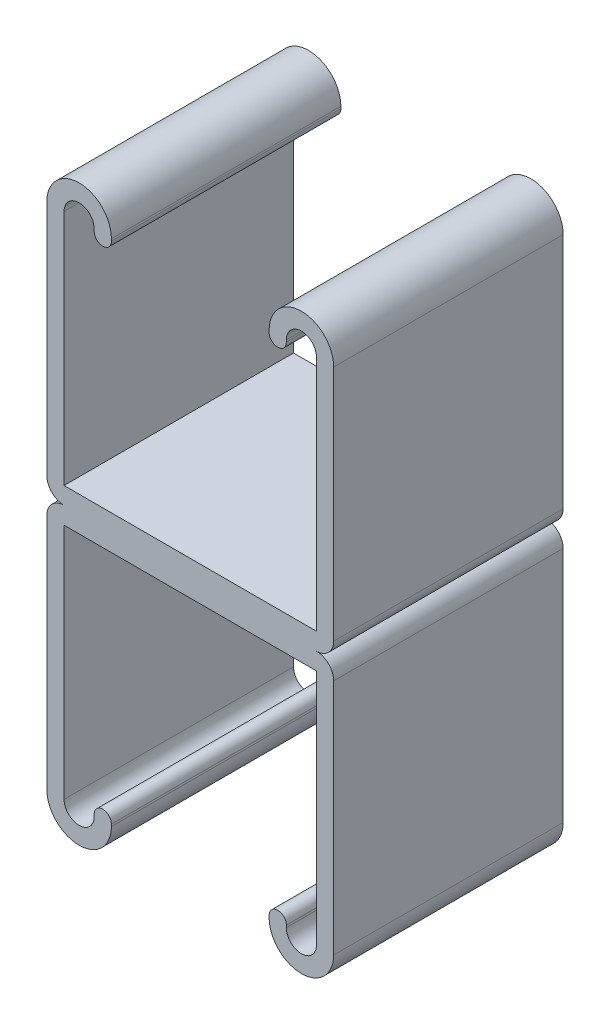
ISO-10303-21;
HEADER;
FILE_DESCRIPTION(('STEP AP214'),'2;1');
FILE_NAME('part.step','',(''),(''),'','','');
FILE_SCHEMA(('AUTOMOTIVE_DESIGN { 1 0 10303 214 1 1 1 1 }'));
ENDSEC;
DATA;
#1=APPLICATION_CONTEXT('core data for automotive mechanical design processes');
#2=APPLICATION_PROTOCOL_DEFINITION('international standard','automotive_design',2000,#1);
#3=PRODUCT_CONTEXT('',#1,'mechanical');
#4=PRODUCT('Part','Part','',(#3));
#5=PRODUCT_RELATED_PRODUCT_CATEGORY('part','',(#4));
#6=PRODUCT_DEFINITION_FORMATION('','',#4);
#7=PRODUCT_DEFINITION_CONTEXT('part definition',#1,'design');
#8=PRODUCT_DEFINITION('design','',#6,#7);
#9=PRODUCT_DEFINITION_SHAPE('','',#8);
#10=(LENGTH_UNIT() NAMED_UNIT(*) SI_UNIT(.MILLI.,.METRE.));
#11=(NAMED_UNIT(*) PLANE_ANGLE_UNIT() SI_UNIT($,.RADIAN.));
#12=(NAMED_UNIT(*) SI_UNIT($,.STERADIAN.) SOLID_ANGLE_UNIT());
#13=UNCERTAINTY_MEASURE_WITH_UNIT(LENGTH_MEASURE(1.E-05),#10,'distance_accuracy_value','');
#14=(GEOMETRIC_REPRESENTATION_CONTEXT(3) GLOBAL_UNCERTAINTY_ASSIGNED_CONTEXT((#13)) GLOBAL_UNIT_ASSIGNED_CONTEXT((#10,
#11,#12)) REPRESENTATION_CONTEXT('',''));
#15=CARTESIAN_POINT('',(0.,0.,0.));
#16=DIRECTION('',(0.,0.,1.));
#17=DIRECTION('',(1.,0.,0.));
#18=AXIS2_PLACEMENT_3D('',#15,#16,#17);
#19=CARTESIAN_POINT('',(-12.303125,28.178125,12.7));
#20=DIRECTION('',(0.,0.,-1.));
#21=DIRECTION('',(-1.,0.,0.));
#22=AXIS2_PLACEMENT_3D('',#19,#20,#21);
#23=CYLINDRICAL_SURFACE('',#22,3.571875);
#24=CARTESIAN_POINT('',(-12.303125,28.178125,-12.7));
#25=DIRECTION('',(0.,0.,1.));
#26=DIRECTION('',(-1.,0.,0.));
#27=AXIS2_PLACEMENT_3D('',#24,#25,#26);
#28=CIRCLE('',#27,3.571875);
#29=CARTESIAN_POINT('',(-8.73125,28.178125,-12.7));
#30=VERTEX_POINT('',#29);
#31=CARTESIAN_POINT('',(-15.875,28.178125,-12.7));
#32=VERTEX_POINT('',#31);
#33=EDGE_CURVE('E196',#30,#32,#28,.T.);
#34=ORIENTED_EDGE('',*,*,#33,.T.);
#35=DIRECTION('',(0.,0.,-1.));
#36=VECTOR('',#35,1.);
#37=CARTESIAN_POINT('',(-15.875,28.178125,12.7));
#38=LINE('',#37,#36);
#39=CARTESIAN_POINT('',(-15.875,28.178125,12.7));
#40=VERTEX_POINT('',#39);
#41=EDGE_CURVE('E11',#40,#32,#38,.T.);
#42=ORIENTED_EDGE('',*,*,#41,.F.);
#43=CARTESIAN_POINT('',(-12.303125,28.178125,12.7));
#44=DIRECTION('',(0.,0.,1.));
#45=DIRECTION('',(-1.,0.,0.));
#46=AXIS2_PLACEMENT_3D('',#43,#44,#45);
#47=CIRCLE('',#46,3.571875);
#48=CARTESIAN_POINT('',(-8.73125,28.178125,12.7));
#49=VERTEX_POINT('',#48);
#50=EDGE_CURVE('E229',#49,#40,#47,.T.);
#51=ORIENTED_EDGE('',*,*,#50,.F.);
#52=DIRECTION('',(0.,0.,-1.));
#53=VECTOR('',#52,1.);
#54=CARTESIAN_POINT('',(-8.73125,28.178125,12.7));
#55=LINE('',#54,#53);
#56=EDGE_CURVE('E192',#49,#30,#55,.T.);
#57=ORIENTED_EDGE('',*,*,#56,.T.);
#58=EDGE_LOOP('',(#34,#42,#51,#57));
#59=FACE_BOUND('',#58,.T.);
#60=ADVANCED_FACE('F39',(#59),#23,.T.);
#61=CARTESIAN_POINT('',(-15.875,28.178125,12.7));
#62=DIRECTION('',(1.,0.,0.));
#63=DIRECTION('',(0.,1.,0.));
#64=AXIS2_PLACEMENT_3D('',#61,#62,#63);
#65=PLANE('',#64);
#66=DIRECTION('',(0.,-1.,0.));
#67=VECTOR('',#66,1.);
#68=CARTESIAN_POINT('',(-15.875,28.178125,-12.7));
#69=LINE('',#68,#67);
#70=CARTESIAN_POINT('',(-15.875,1.905,-12.7));
#71=VERTEX_POINT('',#70);
#72=EDGE_CURVE('E199',#32,#71,#69,.T.);
#73=ORIENTED_EDGE('',*,*,#72,.T.);
#74=DIRECTION('',(0.,0.,-1.));
#75=VECTOR('',#74,1.);
#76=CARTESIAN_POINT('',(-15.875,1.905,12.7));
#77=LINE('',#76,#75);
#78=CARTESIAN_POINT('',(-15.875,1.905,12.7));
#79=VERTEX_POINT('',#78);
#80=EDGE_CURVE('E47',#79,#71,#77,.T.);
#81=ORIENTED_EDGE('',*,*,#80,.F.);
#82=DIRECTION('',(0.,-1.,0.));
#83=VECTOR('',#82,1.);
#84=CARTESIAN_POINT('',(-15.875,28.178125,12.7));
#85=LINE('',#84,#83);
#86=EDGE_CURVE('E126',#40,#79,#85,.T.);
#87=ORIENTED_EDGE('',*,*,#86,.F.);
#88=ORIENTED_EDGE('',*,*,#41,.T.);
#89=EDGE_LOOP('',(#73,#81,#87,#88));
#90=FACE_BOUND('',#89,.T.);
#91=ADVANCED_FACE('F392',(#90),#65,.F.);
#92=CARTESIAN_POINT('',(-13.97,1.905,12.7));
#93=DIRECTION('',(0.,0.,-1.));
#94=DIRECTION('',(-1.,0.,0.));
#95=AXIS2_PLACEMENT_3D('',#92,#93,#94);
#96=CYLINDRICAL_SURFACE('',#95,1.905);
#97=CARTESIAN_POINT('',(-13.97,1.905,-12.7));
#98=DIRECTION('',(0.,0.,1.));
#99=DIRECTION('',(-1.,0.,0.));
#100=AXIS2_PLACEMENT_3D('',#97,#98,#99);
#101=CIRCLE('',#100,1.905);
#102=CARTESIAN_POINT('',(-13.97,0.,-12.7));
#103=VERTEX_POINT('',#102);
#104=EDGE_CURVE('E202',#71,#103,#101,.T.);
#105=ORIENTED_EDGE('',*,*,#104,.T.);
#106=DIRECTION('',(0.,0.,-1.));
#107=VECTOR('',#106,1.);
#108=CARTESIAN_POINT('',(-13.97,0.,12.7));
#109=LINE('',#108,#107);
#110=CARTESIAN_POINT('',(-13.97,0.,12.7));
#111=VERTEX_POINT('',#110);
#112=EDGE_CURVE('E266',#111,#103,#109,.T.);
#113=ORIENTED_EDGE('',*,*,#112,.F.);
#114=CARTESIAN_POINT('',(-13.97,1.905,12.7));
#115=DIRECTION('',(0.,0.,1.));
#116=DIRECTION('',(-1.,0.,0.));
#117=AXIS2_PLACEMENT_3D('',#114,#115,#116);
#118=CIRCLE('',#117,1.905);
#119=EDGE_CURVE('E274',#79,#111,#118,.T.);
#120=ORIENTED_EDGE('',*,*,#119,.F.);
#121=ORIENTED_EDGE('',*,*,#80,.T.);
#122=EDGE_LOOP('',(#105,#113,#120,#121));
#123=FACE_BOUND('',#122,.T.);
#124=ADVANCED_FACE('F272',(#123),#96,.T.);
#125=CARTESIAN_POINT('',(13.97,1.905,12.7));
#126=DIRECTION('',(0.,0.,-1.));
#127=DIRECTION('',(-1.,0.,0.));
#128=AXIS2_PLACEMENT_3D('',#125,#126,#127);
#129=CYLINDRICAL_SURFACE('',#128,1.905);
#130=CARTESIAN_POINT('',(13.97,1.905,-12.7));
#131=DIRECTION('',(0.,0.,1.));
#132=DIRECTION('',(1.,0.,0.));
#133=AXIS2_PLACEMENT_3D('',#130,#131,#132);
#134=CIRCLE('',#133,1.905);
#135=CARTESIAN_POINT('',(13.97,0.,-12.7));
#136=VERTEX_POINT('',#135);
#137=CARTESIAN_POINT('',(15.875,1.905,-12.7));
#138=VERTEX_POINT('',#137);
#139=EDGE_CURVE('E204',#136,#138,#134,.T.);
#140=ORIENTED_EDGE('',*,*,#139,.T.);
#141=DIRECTION('',(0.,0.,-1.));
#142=VECTOR('',#141,1.);
#143=CARTESIAN_POINT('',(15.875,1.905,12.7));
#144=LINE('',#143,#142);
#145=CARTESIAN_POINT('',(15.875,1.905,12.7));
#146=VERTEX_POINT('',#145);
#147=EDGE_CURVE('E260',#146,#138,#144,.T.);
#148=ORIENTED_EDGE('',*,*,#147,.F.);
#149=CARTESIAN_POINT('',(13.97,1.905,12.7));
#150=DIRECTION('',(0.,0.,1.));
#151=DIRECTION('',(1.,0.,0.));
#152=AXIS2_PLACEMENT_3D('',#149,#150,#151);
#153=CIRCLE('',#152,1.905);
#154=CARTESIAN_POINT('',(13.97,0.,12.7));
#155=VERTEX_POINT('',#154);
#156=EDGE_CURVE('E348',#155,#146,#153,.T.);
#157=ORIENTED_EDGE('',*,*,#156,.F.);
#158=DIRECTION('',(0.,0.,-1.));
#159=VECTOR('',#158,1.);
#160=CARTESIAN_POINT('',(13.97,0.,12.7));
#161=LINE('',#160,#159);
#162=EDGE_CURVE('E263',#155,#136,#161,.T.);
#163=ORIENTED_EDGE('',*,*,#162,.T.);
#164=EDGE_LOOP('',(#140,#148,#157,#163));
#165=FACE_BOUND('',#164,.T.);
#166=ADVANCED_FACE('F399',(#165),#129,.T.);
#167=CARTESIAN_POINT('',(15.875,1.905,12.7));
#168=DIRECTION('',(-1.,0.,0.));
#169=DIRECTION('',(0.,0.,1.));
#170=AXIS2_PLACEMENT_3D('',#167,#168,#169);
#171=PLANE('',#170);
#172=DIRECTION('',(0.,1.,0.));
#173=VECTOR('',#172,1.);
#174=CARTESIAN_POINT('',(15.875,1.905,-12.7));
#175=LINE('',#174,#173);
#176=CARTESIAN_POINT('',(15.875,28.178125,-12.7));
#177=VERTEX_POINT('',#176);
#178=EDGE_CURVE('E206',#138,#177,#175,.T.);
#179=ORIENTED_EDGE('',*,*,#178,.T.);
#180=DIRECTION('',(0.,0.,-1.));
#181=VECTOR('',#180,1.);
#182=CARTESIAN_POINT('',(15.875,28.178125,12.7));
#183=LINE('',#182,#181);
#184=CARTESIAN_POINT('',(15.875,28.178125,12.7));
#185=VERTEX_POINT('',#184);
#186=EDGE_CURVE('E257',#185,#177,#183,.T.);
#187=ORIENTED_EDGE('',*,*,#186,.F.);
#188=DIRECTION('',(0.,1.,0.));
#189=VECTOR('',#188,1.);
#190=CARTESIAN_POINT('',(15.875,1.905,12.7));
#191=LINE('',#190,#189);
#192=EDGE_CURVE('E350',#146,#185,#191,.T.);
#193=ORIENTED_EDGE('',*,*,#192,.F.);
#194=ORIENTED_EDGE('',*,*,#147,.T.);
#195=EDGE_LOOP('',(#179,#187,#193,#194));
#196=FACE_BOUND('',#195,.T.);
#197=ADVANCED_FACE('F404',(#196),#171,.F.);
#198=CARTESIAN_POINT('',(12.303125,28.178125,12.7));
#199=DIRECTION('',(0.,0.,-1.));
#200=DIRECTION('',(-1.,0.,0.));
#201=AXIS2_PLACEMENT_3D('',#198,#199,#200);
#202=CYLINDRICAL_SURFACE('',#201,3.571875);
#203=CARTESIAN_POINT('',(12.303125,28.178125,-12.7));
#204=DIRECTION('',(0.,0.,1.));
#205=DIRECTION('',(1.,0.,0.));
#206=AXIS2_PLACEMENT_3D('',#203,#204,#205);
#207=CIRCLE('',#206,3.571875);
#208=CARTESIAN_POINT('',(8.73125,28.178125,-12.7));
#209=VERTEX_POINT('',#208);
#210=EDGE_CURVE('E208',#177,#209,#207,.T.);
#211=ORIENTED_EDGE('',*,*,#210,.T.);
#212=DIRECTION('',(0.,0.,-1.));
#213=VECTOR('',#212,1.);
#214=CARTESIAN_POINT('',(8.73125,28.178125,12.7));
#215=LINE('',#214,#213);
#216=CARTESIAN_POINT('',(8.73125,28.178125,12.7));
#217=VERTEX_POINT('',#216);
#218=EDGE_CURVE('E254',#217,#209,#215,.T.);
#219=ORIENTED_EDGE('',*,*,#218,.F.);
#220=CARTESIAN_POINT('',(12.303125,28.178125,12.7));
#221=DIRECTION('',(0.,0.,1.));
#222=DIRECTION('',(1.,0.,0.));
#223=AXIS2_PLACEMENT_3D('',#220,#221,#222);
#224=CIRCLE('',#223,3.571875);
#225=EDGE_CURVE('E352',#185,#217,#224,.T.);
#226=ORIENTED_EDGE('',*,*,#225,.F.);
#227=ORIENTED_EDGE('',*,*,#186,.T.);
#228=EDGE_LOOP('',(#211,#219,#226,#227));
#229=FACE_BOUND('',#228,.T.);
#230=ADVANCED_FACE('F407',(#229),#202,.T.);
#231=CARTESIAN_POINT('',(8.73125,28.178125,12.7));
#232=DIRECTION('',(1.,0.,0.));
#233=DIRECTION('',(0.,1.,0.));
#234=AXIS2_PLACEMENT_3D('',#231,#232,#233);
#235=PLANE('',#234);
#236=DIRECTION('',(0.,-1.,0.));
#237=VECTOR('',#236,1.);
#238=CARTESIAN_POINT('',(8.73125,28.178125,-12.7));
#239=LINE('',#238,#237);
#240=CARTESIAN_POINT('',(8.73125,27.94,-12.7));
#241=VERTEX_POINT('',#240);
#242=EDGE_CURVE('E210',#209,#241,#239,.T.);
#243=ORIENTED_EDGE('',*,*,#242,.T.);
#244=DIRECTION('',(0.,0.,-1.));
#245=VECTOR('',#244,1.);
#246=CARTESIAN_POINT('',(8.73125,27.94,12.7));
#247=LINE('',#246,#245);
#248=CARTESIAN_POINT('',(8.73125,27.94,12.7));
#249=VERTEX_POINT('',#248);
#250=EDGE_CURVE('E251',#249,#241,#247,.T.);
#251=ORIENTED_EDGE('',*,*,#250,.F.);
#252=DIRECTION('',(0.,-1.,0.));
#253=VECTOR('',#252,1.);
#254=CARTESIAN_POINT('',(8.73125,28.178125,12.7));
#255=LINE('',#254,#253);
#256=EDGE_CURVE('E354',#217,#249,#255,.T.);
#257=ORIENTED_EDGE('',*,*,#256,.F.);
#258=ORIENTED_EDGE('',*,*,#218,.T.);
#259=EDGE_LOOP('',(#243,#251,#257,#258));
#260=FACE_BOUND('',#259,.T.);
#261=ADVANCED_FACE('F411',(#260),#235,.F.);
#262=CARTESIAN_POINT('',(9.68375,27.94,12.7));
#263=DIRECTION('',(0.,0.,-1.));
#264=DIRECTION('',(-1.,0.,0.));
#265=AXIS2_PLACEMENT_3D('',#262,#263,#264);
#266=CYLINDRICAL_SURFACE('',#265,0.9525);
#267=CARTESIAN_POINT('',(9.68375,27.94,-12.7));
#268=DIRECTION('',(0.,0.,1.));
#269=DIRECTION('',(1.,0.,0.));
#270=AXIS2_PLACEMENT_3D('',#267,#268,#269);
#271=CIRCLE('',#270,0.9525);
#272=CARTESIAN_POINT('',(10.63625,27.94,-12.7));
#273=VERTEX_POINT('',#272);
#274=EDGE_CURVE('E212',#241,#273,#271,.T.);
#275=ORIENTED_EDGE('',*,*,#274,.T.);
#276=DIRECTION('',(0.,0.,-1.));
#277=VECTOR('',#276,1.);
#278=CARTESIAN_POINT('',(10.63625,27.94,12.7));
#279=LINE('',#278,#277);
#280=CARTESIAN_POINT('',(10.63625,27.94,12.7));
#281=VERTEX_POINT('',#280);
#282=EDGE_CURVE('E248',#281,#273,#279,.T.);
#283=ORIENTED_EDGE('',*,*,#282,.F.);
#284=CARTESIAN_POINT('',(9.68375,27.94,12.7));
#285=DIRECTION('',(0.,0.,1.));
#286=DIRECTION('',(1.,0.,0.));
#287=AXIS2_PLACEMENT_3D('',#284,#285,#286);
#288=CIRCLE('',#287,0.9525);
#289=EDGE_CURVE('E356',#249,#281,#288,.T.);
#290=ORIENTED_EDGE('',*,*,#289,.F.);
#291=ORIENTED_EDGE('',*,*,#250,.T.);
#292=EDGE_LOOP('',(#275,#283,#290,#291));
#293=FACE_BOUND('',#292,.T.);
#294=ADVANCED_FACE('F415',(#293),#266,.T.);
#295=CARTESIAN_POINT('',(10.63625,28.178125,12.7));
#296=DIRECTION('',(-1.,0.,0.));
#297=DIRECTION('',(0.,0.,1.));
#298=AXIS2_PLACEMENT_3D('',#295,#296,#297);
#299=PLANE('',#298);
#300=DIRECTION('',(0.,1.,0.));
#301=VECTOR('',#300,1.);
#302=CARTESIAN_POINT('',(10.63625,28.178125,-12.7));
#303=LINE('',#302,#301);
#304=CARTESIAN_POINT('',(10.63625,28.178125,-12.7));
#305=VERTEX_POINT('',#304);
#306=EDGE_CURVE('E214',#273,#305,#303,.T.);
#307=ORIENTED_EDGE('',*,*,#306,.T.);
#308=DIRECTION('',(0.,0.,-1.));
#309=VECTOR('',#308,1.);
#310=CARTESIAN_POINT('',(10.63625,28.178125,12.7));
#311=LINE('',#310,#309);
#312=CARTESIAN_POINT('',(10.63625,28.178125,12.7));
#313=VERTEX_POINT('',#312);
#314=EDGE_CURVE('E245',#313,#305,#311,.T.);
#315=ORIENTED_EDGE('',*,*,#314,.F.);
#316=DIRECTION('',(0.,1.,0.));
#317=VECTOR('',#316,1.);
#318=CARTESIAN_POINT('',(10.63625,28.178125,12.7));
#319=LINE('',#318,#317);
#320=EDGE_CURVE('E358',#281,#313,#319,.T.);
#321=ORIENTED_EDGE('',*,*,#320,.F.);
#322=ORIENTED_EDGE('',*,*,#282,.T.);
#323=EDGE_LOOP('',(#307,#315,#321,#322));
#324=FACE_BOUND('',#323,.T.);
#325=ADVANCED_FACE('F419',(#324),#299,.F.);
#326=CARTESIAN_POINT('',(12.303125,28.178125,12.7));
#327=DIRECTION('',(0.,0.,-1.));
#328=DIRECTION('',(-1.,0.,0.));
#329=AXIS2_PLACEMENT_3D('',#326,#327,#328);
#330=CYLINDRICAL_SURFACE('',#329,1.666875);
#331=CARTESIAN_POINT('',(12.303125,28.178125,-12.7));
#332=DIRECTION('',(0.,0.,-1.));
#333=DIRECTION('',(1.,0.,0.));
#334=AXIS2_PLACEMENT_3D('',#331,#332,#333);
#335=CIRCLE('',#334,1.666875);
#336=CARTESIAN_POINT('',(13.97,28.178125,-12.7));
#337=VERTEX_POINT('',#336);
#338=EDGE_CURVE('E216',#305,#337,#335,.T.);
#339=ORIENTED_EDGE('',*,*,#338,.T.);
#340=DIRECTION('',(0.,0.,-1.));
#341=VECTOR('',#340,1.);
#342=CARTESIAN_POINT('',(13.97,28.178125,12.7));
#343=LINE('',#342,#341);
#344=CARTESIAN_POINT('',(13.97,28.178125,12.7));
#345=VERTEX_POINT('',#344);
#346=EDGE_CURVE('E242',#345,#337,#343,.T.);
#347=ORIENTED_EDGE('',*,*,#346,.F.);
#348=CARTESIAN_POINT('',(12.303125,28.178125,12.7));
#349=DIRECTION('',(0.,0.,-1.));
#350=DIRECTION('',(1.,0.,0.));
#351=AXIS2_PLACEMENT_3D('',#348,#349,#350);
#352=CIRCLE('',#351,1.666875);
#353=EDGE_CURVE('E360',#313,#345,#352,.T.);
#354=ORIENTED_EDGE('',*,*,#353,.F.);
#355=ORIENTED_EDGE('',*,*,#314,.T.);
#356=EDGE_LOOP('',(#339,#347,#354,#355));
#357=FACE_BOUND('',#356,.T.);
#358=ADVANCED_FACE('F423',(#357),#330,.F.);
#359=CARTESIAN_POINT('',(13.97,1.905,12.7));
#360=DIRECTION('',(1.,0.,0.));
#361=DIRECTION('',(0.,0.,-1.));
#362=AXIS2_PLACEMENT_3D('',#359,#360,#361);
#363=PLANE('',#362);
#364=DIRECTION('',(0.,-1.,0.));
#365=VECTOR('',#364,1.);
#366=CARTESIAN_POINT('',(13.97,1.905,-12.7));
#367=LINE('',#366,#365);
#368=CARTESIAN_POINT('',(13.97,1.905,-12.7));
#369=VERTEX_POINT('',#368);
#370=EDGE_CURVE('E218',#337,#369,#367,.T.);
#371=ORIENTED_EDGE('',*,*,#370,.T.);
#372=DIRECTION('',(0.,0.,-1.));
#373=VECTOR('',#372,1.);
#374=CARTESIAN_POINT('',(13.97,1.905,12.7));
#375=LINE('',#374,#373);
#376=CARTESIAN_POINT('',(13.97,1.905,12.7));
#377=VERTEX_POINT('',#376);
#378=EDGE_CURVE('E239',#377,#369,#375,.T.);
#379=ORIENTED_EDGE('',*,*,#378,.F.);
#380=DIRECTION('',(0.,-1.,0.));
#381=VECTOR('',#380,1.);
#382=CARTESIAN_POINT('',(13.97,1.905,12.7));
#383=LINE('',#382,#381);
#384=EDGE_CURVE('E362',#345,#377,#383,.T.);
#385=ORIENTED_EDGE('',*,*,#384,.F.);
#386=ORIENTED_EDGE('',*,*,#346,.T.);
#387=EDGE_LOOP('',(#371,#379,#385,#386));
#388=FACE_BOUND('',#387,.T.);
#389=ADVANCED_FACE('F427',(#388),#363,.F.);
#390=CARTESIAN_POINT('',(-13.97,1.905,12.7));
#391=DIRECTION('',(0.,-1.,0.));
#392=DIRECTION('',(1.,0.,0.));
#393=AXIS2_PLACEMENT_3D('',#390,#391,#392);
#394=PLANE('',#393);
#395=DIRECTION('',(-1.,0.,0.));
#396=VECTOR('',#395,1.);
#397=CARTESIAN_POINT('',(-13.97,1.905,-12.7));
#398=LINE('',#397,#396);
#399=CARTESIAN_POINT('',(-13.97,1.905,-12.7));
#400=VERTEX_POINT('',#399);
#401=EDGE_CURVE('E220',#369,#400,#398,.T.);
#402=ORIENTED_EDGE('',*,*,#401,.T.);
#403=DIRECTION('',(0.,0.,-1.));
#404=VECTOR('',#403,1.);
#405=CARTESIAN_POINT('',(-13.97,1.905,12.7));
#406=LINE('',#405,#404);
#407=CARTESIAN_POINT('',(-13.97,1.905,12.7));
#408=VERTEX_POINT('',#407);
#409=EDGE_CURVE('E236',#408,#400,#406,.T.);
#410=ORIENTED_EDGE('',*,*,#409,.F.);
#411=DIRECTION('',(-1.,0.,0.));
#412=VECTOR('',#411,1.);
#413=CARTESIAN_POINT('',(-13.97,1.905,12.7));
#414=LINE('',#413,#412);
#415=EDGE_CURVE('E364',#377,#408,#414,.T.);
#416=ORIENTED_EDGE('',*,*,#415,.F.);
#417=ORIENTED_EDGE('',*,*,#378,.T.);
#418=EDGE_LOOP('',(#402,#410,#416,#417));
#419=FACE_BOUND('',#418,.T.);
#420=ADVANCED_FACE('F431',(#419),#394,.F.);
#421=CARTESIAN_POINT('',(-13.97,28.178125,12.7));
#422=DIRECTION('',(-1.,0.,0.));
#423=DIRECTION('',(0.,-1.,0.));
#424=AXIS2_PLACEMENT_3D('',#421,#422,#423);
#425=PLANE('',#424);
#426=DIRECTION('',(0.,1.,0.));
#427=VECTOR('',#426,1.);
#428=CARTESIAN_POINT('',(-13.97,28.178125,-12.7));
#429=LINE('',#428,#427);
#430=CARTESIAN_POINT('',(-13.97,28.178125,-12.7));
#431=VERTEX_POINT('',#430);
#432=EDGE_CURVE('E222',#400,#431,#429,.T.);
#433=ORIENTED_EDGE('',*,*,#432,.T.);
#434=DIRECTION('',(0.,0.,-1.));
#435=VECTOR('',#434,1.);
#436=CARTESIAN_POINT('',(-13.97,28.178125,12.7));
#437=LINE('',#436,#435);
#438=CARTESIAN_POINT('',(-13.97,28.178125,12.7));
#439=VERTEX_POINT('',#438);
#440=EDGE_CURVE('E233',#439,#431,#437,.T.);
#441=ORIENTED_EDGE('',*,*,#440,.F.);
#442=DIRECTION('',(0.,1.,0.));
#443=VECTOR('',#442,1.);
#444=CARTESIAN_POINT('',(-13.97,28.178125,12.7));
#445=LINE('',#444,#443);
#446=EDGE_CURVE('E366',#408,#439,#445,.T.);
#447=ORIENTED_EDGE('',*,*,#446,.F.);
#448=ORIENTED_EDGE('',*,*,#409,.T.);
#449=EDGE_LOOP('',(#433,#441,#447,#448));
#450=FACE_BOUND('',#449,.T.);
#451=ADVANCED_FACE('F372',(#450),#425,.F.);
#452=CARTESIAN_POINT('',(-12.303125,28.178125,12.7));
#453=DIRECTION('',(0.,0.,-1.));
#454=DIRECTION('',(-1.,0.,0.));
#455=AXIS2_PLACEMENT_3D('',#452,#453,#454);
#456=CYLINDRICAL_SURFACE('',#455,1.666875);
#457=CARTESIAN_POINT('',(-12.303125,28.178125,-12.7));
#458=DIRECTION('',(0.,0.,-1.));
#459=DIRECTION('',(-1.,0.,0.));
#460=AXIS2_PLACEMENT_3D('',#457,#458,#459);
#461=CIRCLE('',#460,1.666875);
#462=CARTESIAN_POINT('',(-10.63625,28.178125,-12.7));
#463=VERTEX_POINT('',#462);
#464=EDGE_CURVE('E224',#431,#463,#461,.T.);
#465=ORIENTED_EDGE('',*,*,#464,.T.);
#466=DIRECTION('',(0.,0.,-1.));
#467=VECTOR('',#466,1.);
#468=CARTESIAN_POINT('',(-10.63625,28.178125,12.7));
#469=LINE('',#468,#467);
#470=CARTESIAN_POINT('',(-10.63625,28.178125,12.7));
#471=VERTEX_POINT('',#470);
#472=EDGE_CURVE('E187',#471,#463,#469,.T.);
#473=ORIENTED_EDGE('',*,*,#472,.F.);
#474=CARTESIAN_POINT('',(-12.303125,28.178125,12.7));
#475=DIRECTION('',(0.,0.,-1.));
#476=DIRECTION('',(-1.,0.,0.));
#477=AXIS2_PLACEMENT_3D('',#474,#475,#476);
#478=CIRCLE('',#477,1.666875);
#479=EDGE_CURVE('E178',#439,#471,#478,.T.);
#480=ORIENTED_EDGE('',*,*,#479,.F.);
#481=ORIENTED_EDGE('',*,*,#440,.T.);
#482=EDGE_LOOP('',(#465,#473,#480,#481));
#483=FACE_BOUND('',#482,.T.);
#484=ADVANCED_FACE('F376',(#483),#456,.F.);
#485=CARTESIAN_POINT('',(-10.63625,28.178125,12.7));
#486=DIRECTION('',(1.,0.,0.));
#487=DIRECTION('',(0.,1.,0.));
#488=AXIS2_PLACEMENT_3D('',#485,#486,#487);
#489=PLANE('',#488);
#490=DIRECTION('',(0.,-1.,0.));
#491=VECTOR('',#490,1.);
#492=CARTESIAN_POINT('',(-10.63625,28.178125,-12.7));
#493=LINE('',#492,#491);
#494=CARTESIAN_POINT('',(-10.63625,27.94,-12.7));
#495=VERTEX_POINT('',#494);
#496=EDGE_CURVE('E186',#463,#495,#493,.T.);
#497=ORIENTED_EDGE('',*,*,#496,.T.);
#498=DIRECTION('',(0.,0.,-1.));
#499=VECTOR('',#498,1.);
#500=CARTESIAN_POINT('',(-10.63625,27.94,12.7));
#501=LINE('',#500,#499);
#502=CARTESIAN_POINT('',(-10.63625,27.94,12.7));
#503=VERTEX_POINT('',#502);
#504=EDGE_CURVE('E183',#503,#495,#501,.T.);
#505=ORIENTED_EDGE('',*,*,#504,.F.);
#506=DIRECTION('',(0.,-1.,0.));
#507=VECTOR('',#506,1.);
#508=CARTESIAN_POINT('',(-10.63625,28.178125,12.7));
#509=LINE('',#508,#507);
#510=EDGE_CURVE('E172',#471,#503,#509,.T.);
#511=ORIENTED_EDGE('',*,*,#510,.F.);
#512=ORIENTED_EDGE('',*,*,#472,.T.);
#513=EDGE_LOOP('',(#497,#505,#511,#512));
#514=FACE_BOUND('',#513,.T.);
#515=ADVANCED_FACE('F184',(#514),#489,.F.);
#516=CARTESIAN_POINT('',(-9.68375,27.94,12.7));
#517=DIRECTION('',(0.,0.,-1.));
#518=DIRECTION('',(-1.,0.,0.));
#519=AXIS2_PLACEMENT_3D('',#516,#517,#518);
#520=CYLINDRICAL_SURFACE('',#519,0.9525);
#521=CARTESIAN_POINT('',(-9.68375,27.94,-12.7));
#522=DIRECTION('',(0.,0.,1.));
#523=DIRECTION('',(-1.,0.,0.));
#524=AXIS2_PLACEMENT_3D('',#521,#522,#523);
#525=CIRCLE('',#524,0.9525);
#526=CARTESIAN_POINT('',(-8.73125,27.94,-12.7));
#527=VERTEX_POINT('',#526);
#528=EDGE_CURVE('E112',#495,#527,#525,.T.);
#529=ORIENTED_EDGE('',*,*,#528,.T.);
#530=DIRECTION('',(0.,0.,-1.));
#531=VECTOR('',#530,1.);
#532=CARTESIAN_POINT('',(-8.73125,27.94,12.7));
#533=LINE('',#532,#531);
#534=CARTESIAN_POINT('',(-8.73125,27.94,12.7));
#535=VERTEX_POINT('',#534);
#536=EDGE_CURVE('E188',#535,#527,#533,.T.);
#537=ORIENTED_EDGE('',*,*,#536,.F.);
#538=CARTESIAN_POINT('',(-9.68375,27.94,12.7));
#539=DIRECTION('',(0.,0.,1.));
#540=DIRECTION('',(-1.,0.,0.));
#541=AXIS2_PLACEMENT_3D('',#538,#539,#540);
#542=CIRCLE('',#541,0.9525);
#543=EDGE_CURVE('E176',#503,#535,#542,.T.);
#544=ORIENTED_EDGE('',*,*,#543,.F.);
#545=ORIENTED_EDGE('',*,*,#504,.T.);
#546=EDGE_LOOP('',(#529,#537,#544,#545));
#547=FACE_BOUND('',#546,.T.);
#548=ADVANCED_FACE('F190',(#547),#520,.T.);
#549=CARTESIAN_POINT('',(-8.73125,28.178125,12.7));
#550=DIRECTION('',(-1.,0.,0.));
#551=DIRECTION('',(0.,-1.,0.));
#552=AXIS2_PLACEMENT_3D('',#549,#550,#551);
#553=PLANE('',#552);
#554=DIRECTION('',(0.,1.,0.));
#555=VECTOR('',#554,1.);
#556=CARTESIAN_POINT('',(-8.73125,28.178125,-12.7));
#557=LINE('',#556,#555);
#558=EDGE_CURVE('E118',#527,#30,#557,.T.);
#559=ORIENTED_EDGE('',*,*,#558,.T.);
#560=ORIENTED_EDGE('',*,*,#56,.F.);
#561=DIRECTION('',(0.,1.,0.));
#562=VECTOR('',#561,1.);
#563=CARTESIAN_POINT('',(-8.73125,28.178125,12.7));
#564=LINE('',#563,#562);
#565=EDGE_CURVE('E55',#535,#49,#564,.T.);
#566=ORIENTED_EDGE('',*,*,#565,.F.);
#567=ORIENTED_EDGE('',*,*,#536,.T.);
#568=EDGE_LOOP('',(#559,#560,#566,#567));
#569=FACE_BOUND('',#568,.T.);
#570=ADVANCED_FACE('F380',(#569),#553,.F.);
#571=CARTESIAN_POINT('',(-12.303125,28.178125,12.7));
#572=DIRECTION('',(0.,0.,-1.));
#573=DIRECTION('',(-1.,0.,0.));
#574=AXIS2_PLACEMENT_3D('',#571,#572,#573);
#575=PLANE('',#574);
#576=ORIENTED_EDGE('',*,*,#50,.T.);
#577=ORIENTED_EDGE('',*,*,#86,.T.);
#578=ORIENTED_EDGE('',*,*,#119,.T.);
#579=CARTESIAN_POINT('',(-13.97,-1.905,12.7));
#580=DIRECTION('',(0.,0.,-1.));
#581=DIRECTION('',(-1.,0.,0.));
#582=AXIS2_PLACEMENT_3D('',#579,#580,#581);
#583=CIRCLE('',#582,1.905);
#584=CARTESIAN_POINT('',(-15.875,-1.905,12.7));
#585=VERTEX_POINT('',#584);
#586=EDGE_CURVE('E779',#585,#111,#583,.T.);
#587=ORIENTED_EDGE('',*,*,#586,.F.);
#588=DIRECTION('',(0.,1.,0.));
#589=VECTOR('',#588,1.);
#590=CARTESIAN_POINT('',(-15.875,-28.178125,12.7));
#591=LINE('',#590,#589);
#592=CARTESIAN_POINT('',(-15.875,-28.178125,12.7));
#593=VERTEX_POINT('',#592);
#594=EDGE_CURVE('E301',#593,#585,#591,.T.);
#595=ORIENTED_EDGE('',*,*,#594,.F.);
#596=CARTESIAN_POINT('',(-12.303125,-28.178125,12.7));
#597=DIRECTION('',(0.,0.,-1.));
#598=DIRECTION('',(-1.,0.,0.));
#599=AXIS2_PLACEMENT_3D('',#596,#597,#598);
#600=CIRCLE('',#599,3.571875);
#601=CARTESIAN_POINT('',(-8.73125,-28.178125,12.7));
#602=VERTEX_POINT('',#601);
#603=EDGE_CURVE('E290',#602,#593,#600,.T.);
#604=ORIENTED_EDGE('',*,*,#603,.F.);
#605=DIRECTION('',(0.,-1.,0.));
#606=VECTOR('',#605,1.);
#607=CARTESIAN_POINT('',(-8.73125,-28.178125,12.7));
#608=LINE('',#607,#606);
#609=CARTESIAN_POINT('',(-8.73125,-27.94,12.7));
#610=VERTEX_POINT('',#609);
#611=EDGE_CURVE('E728',#610,#602,#608,.T.);
#612=ORIENTED_EDGE('',*,*,#611,.F.);
#613=CARTESIAN_POINT('',(-9.68375,-27.94,12.7));
#614=DIRECTION('',(0.,0.,-1.));
#615=DIRECTION('',(-1.,0.,0.));
#616=AXIS2_PLACEMENT_3D('',#613,#614,#615);
#617=CIRCLE('',#616,0.9525);
#618=CARTESIAN_POINT('',(-10.63625,-27.94,12.7));
#619=VERTEX_POINT('',#618);
#620=EDGE_CURVE('E737',#619,#610,#617,.T.);
#621=ORIENTED_EDGE('',*,*,#620,.F.);
#622=DIRECTION('',(0.,1.,0.));
#623=VECTOR('',#622,1.);
#624=CARTESIAN_POINT('',(-10.63625,-28.178125,12.7));
#625=LINE('',#624,#623);
#626=CARTESIAN_POINT('',(-10.63625,-28.178125,12.7));
#627=VERTEX_POINT('',#626);
#628=EDGE_CURVE('E741',#627,#619,#625,.T.);
#629=ORIENTED_EDGE('',*,*,#628,.F.);
#630=CARTESIAN_POINT('',(-12.303125,-28.178125,12.7));
#631=DIRECTION('',(0.,0.,1.));
#632=DIRECTION('',(-1.,0.,0.));
#633=AXIS2_PLACEMENT_3D('',#630,#631,#632);
#634=CIRCLE('',#633,1.666875);
#635=CARTESIAN_POINT('',(-13.97,-28.178125,12.7));
#636=VERTEX_POINT('',#635);
#637=EDGE_CURVE('E743',#636,#627,#634,.T.);
#638=ORIENTED_EDGE('',*,*,#637,.F.);
#639=DIRECTION('',(0.,-1.,0.));
#640=VECTOR('',#639,1.);
#641=CARTESIAN_POINT('',(-13.97,-28.178125,12.7));
#642=LINE('',#641,#640);
#643=CARTESIAN_POINT('',(-13.97,-1.905,12.7));
#644=VERTEX_POINT('',#643);
#645=EDGE_CURVE('E749',#644,#636,#642,.T.);
#646=ORIENTED_EDGE('',*,*,#645,.F.);
#647=DIRECTION('',(-1.,0.,0.));
#648=VECTOR('',#647,1.);
#649=CARTESIAN_POINT('',(-13.97,-1.905,12.7));
#650=LINE('',#649,#648);
#651=CARTESIAN_POINT('',(13.97,-1.905,12.7));
#652=VERTEX_POINT('',#651);
#653=EDGE_CURVE('E752',#652,#644,#650,.T.);
#654=ORIENTED_EDGE('',*,*,#653,.F.);
#655=DIRECTION('',(0.,1.,0.));
#656=VECTOR('',#655,1.);
#657=CARTESIAN_POINT('',(13.97,-1.905,12.7));
#658=LINE('',#657,#656);
#659=CARTESIAN_POINT('',(13.97,-28.178125,12.7));
#660=VERTEX_POINT('',#659);
#661=EDGE_CURVE('E755',#660,#652,#658,.T.);
#662=ORIENTED_EDGE('',*,*,#661,.F.);
#663=CARTESIAN_POINT('',(12.303125,-28.178125,12.7));
#664=DIRECTION('',(0.,0.,1.));
#665=DIRECTION('',(1.,0.,0.));
#666=AXIS2_PLACEMENT_3D('',#663,#664,#665);
#667=CIRCLE('',#666,1.666875);
#668=CARTESIAN_POINT('',(10.63625,-28.178125,12.7));
#669=VERTEX_POINT('',#668);
#670=EDGE_CURVE('E758',#669,#660,#667,.T.);
#671=ORIENTED_EDGE('',*,*,#670,.F.);
#672=DIRECTION('',(0.,-1.,0.));
#673=VECTOR('',#672,1.);
#674=CARTESIAN_POINT('',(10.63625,-28.178125,12.7));
#675=LINE('',#674,#673);
#676=CARTESIAN_POINT('',(10.63625,-27.94,12.7));
#677=VERTEX_POINT('',#676);
#678=EDGE_CURVE('E761',#677,#669,#675,.T.);
#679=ORIENTED_EDGE('',*,*,#678,.F.);
#680=CARTESIAN_POINT('',(9.68375,-27.94,12.7));
#681=DIRECTION('',(0.,0.,-1.));
#682=DIRECTION('',(1.,0.,0.));
#683=AXIS2_PLACEMENT_3D('',#680,#681,#682);
#684=CIRCLE('',#683,0.9525);
#685=CARTESIAN_POINT('',(8.73125,-27.94,12.7));
#686=VERTEX_POINT('',#685);
#687=EDGE_CURVE('E764',#686,#677,#684,.T.);
#688=ORIENTED_EDGE('',*,*,#687,.F.);
#689=DIRECTION('',(0.,1.,0.));
#690=VECTOR('',#689,1.);
#691=CARTESIAN_POINT('',(8.73125,-28.178125,12.7));
#692=LINE('',#691,#690);
#693=CARTESIAN_POINT('',(8.73125,-28.178125,12.7));
#694=VERTEX_POINT('',#693);
#695=EDGE_CURVE('E767',#694,#686,#692,.T.);
#696=ORIENTED_EDGE('',*,*,#695,.F.);
#697=CARTESIAN_POINT('',(12.303125,-28.178125,12.7));
#698=DIRECTION('',(0.,0.,-1.));
#699=DIRECTION('',(1.,0.,0.));
#700=AXIS2_PLACEMENT_3D('',#697,#698,#699);
#701=CIRCLE('',#700,3.571875);
#702=CARTESIAN_POINT('',(15.875,-28.178125,12.7));
#703=VERTEX_POINT('',#702);
#704=EDGE_CURVE('E770',#703,#694,#701,.T.);
#705=ORIENTED_EDGE('',*,*,#704,.F.);
#706=DIRECTION('',(0.,-1.,0.));
#707=VECTOR('',#706,1.);
#708=CARTESIAN_POINT('',(15.875,-1.905,12.7));
#709=LINE('',#708,#707);
#710=CARTESIAN_POINT('',(15.875,-1.905,12.7));
#711=VERTEX_POINT('',#710);
#712=EDGE_CURVE('E773',#711,#703,#709,.T.);
#713=ORIENTED_EDGE('',*,*,#712,.F.);
#714=CARTESIAN_POINT('',(13.97,-1.905,12.7));
#715=DIRECTION('',(0.,0.,-1.));
#716=DIRECTION('',(1.,0.,0.));
#717=AXIS2_PLACEMENT_3D('',#714,#715,#716);
#718=CIRCLE('',#717,1.905);
#719=EDGE_CURVE('E776',#155,#711,#718,.T.);
#720=ORIENTED_EDGE('',*,*,#719,.F.);
#721=ORIENTED_EDGE('',*,*,#156,.T.);
#722=ORIENTED_EDGE('',*,*,#192,.T.);
#723=ORIENTED_EDGE('',*,*,#225,.T.);
#724=ORIENTED_EDGE('',*,*,#256,.T.);
#725=ORIENTED_EDGE('',*,*,#289,.T.);
#726=ORIENTED_EDGE('',*,*,#320,.T.);
#727=ORIENTED_EDGE('',*,*,#353,.T.);
#728=ORIENTED_EDGE('',*,*,#384,.T.);
#729=ORIENTED_EDGE('',*,*,#415,.T.);
#730=ORIENTED_EDGE('',*,*,#446,.T.);
#731=ORIENTED_EDGE('',*,*,#479,.T.);
#732=ORIENTED_EDGE('',*,*,#510,.T.);
#733=ORIENTED_EDGE('',*,*,#543,.T.);
#734=ORIENTED_EDGE('',*,*,#565,.T.);
#735=EDGE_LOOP('',(#576,#577,#578,#587,#595,#604,#612,#621,#629,#638,#646,#654,#662,#671,#679,
#688,#696,#705,#713,#720,#721,#722,#723,#724,#725,#726,#727,#728,#729,#730,#731,#732,#733,#734));
#736=FACE_BOUND('',#735,.T.);
#737=ADVANCED_FACE('F174',(#736),#575,.F.);
#738=CARTESIAN_POINT('',(-12.303125,28.178125,-12.7));
#739=DIRECTION('',(0.,0.,-1.));
#740=DIRECTION('',(-1.,0.,0.));
#741=AXIS2_PLACEMENT_3D('',#738,#739,#740);
#742=PLANE('',#741);
#743=ORIENTED_EDGE('',*,*,#33,.F.);
#744=ORIENTED_EDGE('',*,*,#558,.F.);
#745=ORIENTED_EDGE('',*,*,#528,.F.);
#746=ORIENTED_EDGE('',*,*,#496,.F.);
#747=ORIENTED_EDGE('',*,*,#464,.F.);
#748=ORIENTED_EDGE('',*,*,#432,.F.);
#749=ORIENTED_EDGE('',*,*,#401,.F.);
#750=ORIENTED_EDGE('',*,*,#370,.F.);
#751=ORIENTED_EDGE('',*,*,#338,.F.);
#752=ORIENTED_EDGE('',*,*,#306,.F.);
#753=ORIENTED_EDGE('',*,*,#274,.F.);
#754=ORIENTED_EDGE('',*,*,#242,.F.);
#755=ORIENTED_EDGE('',*,*,#210,.F.);
#756=ORIENTED_EDGE('',*,*,#178,.F.);
#757=ORIENTED_EDGE('',*,*,#139,.F.);
#758=CARTESIAN_POINT('',(13.97,-1.905,-12.7));
#759=DIRECTION('',(0.,0.,-1.));
#760=DIRECTION('',(1.,0.,0.));
#761=AXIS2_PLACEMENT_3D('',#758,#759,#760);
#762=CIRCLE('',#761,1.905);
#763=CARTESIAN_POINT('',(15.875,-1.905,-12.7));
#764=VERTEX_POINT('',#763);
#765=EDGE_CURVE('E288',#136,#764,#762,.T.);
#766=ORIENTED_EDGE('',*,*,#765,.T.);
#767=DIRECTION('',(0.,-1.,0.));
#768=VECTOR('',#767,1.);
#769=CARTESIAN_POINT('',(15.875,-1.905,-12.7));
#770=LINE('',#769,#768);
#771=CARTESIAN_POINT('',(15.875,-28.178125,-12.7));
#772=VERTEX_POINT('',#771);
#773=EDGE_CURVE('E293',#764,#772,#770,.T.);
#774=ORIENTED_EDGE('',*,*,#773,.T.);
#775=CARTESIAN_POINT('',(12.303125,-28.178125,-12.7));
#776=DIRECTION('',(0.,0.,-1.));
#777=DIRECTION('',(1.,0.,0.));
#778=AXIS2_PLACEMENT_3D('',#775,#776,#777);
#779=CIRCLE('',#778,3.571875);
#780=CARTESIAN_POINT('',(8.73125,-28.178125,-12.7));
#781=VERTEX_POINT('',#780);
#782=EDGE_CURVE('E815',#772,#781,#779,.T.);
#783=ORIENTED_EDGE('',*,*,#782,.T.);
#784=DIRECTION('',(0.,1.,0.));
#785=VECTOR('',#784,1.);
#786=CARTESIAN_POINT('',(8.73125,-28.178125,-12.7));
#787=LINE('',#786,#785);
#788=CARTESIAN_POINT('',(8.73125,-27.94,-12.7));
#789=VERTEX_POINT('',#788);
#790=EDGE_CURVE('E812',#781,#789,#787,.T.);
#791=ORIENTED_EDGE('',*,*,#790,.T.);
#792=CARTESIAN_POINT('',(9.68375,-27.94,-12.7));
#793=DIRECTION('',(0.,0.,-1.));
#794=DIRECTION('',(1.,0.,0.));
#795=AXIS2_PLACEMENT_3D('',#792,#793,#794);
#796=CIRCLE('',#795,0.9525);
#797=CARTESIAN_POINT('',(10.63625,-27.94,-12.7));
#798=VERTEX_POINT('',#797);
#799=EDGE_CURVE('E809',#789,#798,#796,.T.);
#800=ORIENTED_EDGE('',*,*,#799,.T.);
#801=DIRECTION('',(0.,-1.,0.));
#802=VECTOR('',#801,1.);
#803=CARTESIAN_POINT('',(10.63625,-28.178125,-12.7));
#804=LINE('',#803,#802);
#805=CARTESIAN_POINT('',(10.63625,-28.178125,-12.7));
#806=VERTEX_POINT('',#805);
#807=EDGE_CURVE('E806',#798,#806,#804,.T.);
#808=ORIENTED_EDGE('',*,*,#807,.T.);
#809=CARTESIAN_POINT('',(12.303125,-28.178125,-12.7));
#810=DIRECTION('',(0.,0.,1.));
#811=DIRECTION('',(1.,0.,0.));
#812=AXIS2_PLACEMENT_3D('',#809,#810,#811);
#813=CIRCLE('',#812,1.666875);
#814=CARTESIAN_POINT('',(13.97,-28.178125,-12.7));
#815=VERTEX_POINT('',#814);
#816=EDGE_CURVE('E803',#806,#815,#813,.T.);
#817=ORIENTED_EDGE('',*,*,#816,.T.);
#818=DIRECTION('',(0.,1.,0.));
#819=VECTOR('',#818,1.);
#820=CARTESIAN_POINT('',(13.97,-1.905,-12.7));
#821=LINE('',#820,#819);
#822=CARTESIAN_POINT('',(13.97,-1.905,-12.7));
#823=VERTEX_POINT('',#822);
#824=EDGE_CURVE('E800',#815,#823,#821,.T.);
#825=ORIENTED_EDGE('',*,*,#824,.T.);
#826=DIRECTION('',(-1.,0.,0.));
#827=VECTOR('',#826,1.);
#828=CARTESIAN_POINT('',(-13.97,-1.905,-12.7));
#829=LINE('',#828,#827);
#830=CARTESIAN_POINT('',(-13.97,-1.905,-12.7));
#831=VERTEX_POINT('',#830);
#832=EDGE_CURVE('E797',#823,#831,#829,.T.);
#833=ORIENTED_EDGE('',*,*,#832,.T.);
#834=DIRECTION('',(0.,-1.,0.));
#835=VECTOR('',#834,1.);
#836=CARTESIAN_POINT('',(-13.97,-28.178125,-12.7));
#837=LINE('',#836,#835);
#838=CARTESIAN_POINT('',(-13.97,-28.178125,-12.7));
#839=VERTEX_POINT('',#838);
#840=EDGE_CURVE('E794',#831,#839,#837,.T.);
#841=ORIENTED_EDGE('',*,*,#840,.T.);
#842=CARTESIAN_POINT('',(-12.303125,-28.178125,-12.7));
#843=DIRECTION('',(0.,0.,1.));
#844=DIRECTION('',(-1.,0.,0.));
#845=AXIS2_PLACEMENT_3D('',#842,#843,#844);
#846=CIRCLE('',#845,1.666875);
#847=CARTESIAN_POINT('',(-10.63625,-28.178125,-12.7));
#848=VERTEX_POINT('',#847);
#849=EDGE_CURVE('E791',#839,#848,#846,.T.);
#850=ORIENTED_EDGE('',*,*,#849,.T.);
#851=DIRECTION('',(0.,1.,0.));
#852=VECTOR('',#851,1.);
#853=CARTESIAN_POINT('',(-10.63625,-28.178125,-12.7));
#854=LINE('',#853,#852);
#855=CARTESIAN_POINT('',(-10.63625,-27.94,-12.7));
#856=VERTEX_POINT('',#855);
#857=EDGE_CURVE('E788',#848,#856,#854,.T.);
#858=ORIENTED_EDGE('',*,*,#857,.T.);
#859=CARTESIAN_POINT('',(-9.68375,-27.94,-12.7));
#860=DIRECTION('',(0.,0.,-1.));
#861=DIRECTION('',(-1.,0.,0.));
#862=AXIS2_PLACEMENT_3D('',#859,#860,#861);
#863=CIRCLE('',#862,0.9525);
#864=CARTESIAN_POINT('',(-8.73125,-27.94,-12.7));
#865=VERTEX_POINT('',#864);
#866=EDGE_CURVE('E786',#856,#865,#863,.T.);
#867=ORIENTED_EDGE('',*,*,#866,.T.);
#868=DIRECTION('',(0.,-1.,0.));
#869=VECTOR('',#868,1.);
#870=CARTESIAN_POINT('',(-8.73125,-28.178125,-12.7));
#871=LINE('',#870,#869);
#872=CARTESIAN_POINT('',(-8.73125,-28.178125,-12.7));
#873=VERTEX_POINT('',#872);
#874=EDGE_CURVE('E730',#865,#873,#871,.T.);
#875=ORIENTED_EDGE('',*,*,#874,.T.);
#876=CARTESIAN_POINT('',(-12.303125,-28.178125,-12.7));
#877=DIRECTION('',(0.,0.,-1.));
#878=DIRECTION('',(-1.,0.,0.));
#879=AXIS2_PLACEMENT_3D('',#876,#877,#878);
#880=CIRCLE('',#879,3.571875);
#881=CARTESIAN_POINT('',(-15.875,-28.178125,-12.7));
#882=VERTEX_POINT('',#881);
#883=EDGE_CURVE('E783',#873,#882,#880,.T.);
#884=ORIENTED_EDGE('',*,*,#883,.T.);
#885=DIRECTION('',(0.,1.,0.));
#886=VECTOR('',#885,1.);
#887=CARTESIAN_POINT('',(-15.875,-28.178125,-12.7));
#888=LINE('',#887,#886);
#889=CARTESIAN_POINT('',(-15.875,-1.905,-12.7));
#890=VERTEX_POINT('',#889);
#891=EDGE_CURVE('E285',#882,#890,#888,.T.);
#892=ORIENTED_EDGE('',*,*,#891,.T.);
#893=CARTESIAN_POINT('',(-13.97,-1.905,-12.7));
#894=DIRECTION('',(0.,0.,-1.));
#895=DIRECTION('',(-1.,0.,0.));
#896=AXIS2_PLACEMENT_3D('',#893,#894,#895);
#897=CIRCLE('',#896,1.905);
#898=EDGE_CURVE('E281',#890,#103,#897,.T.);
#899=ORIENTED_EDGE('',*,*,#898,.T.);
#900=ORIENTED_EDGE('',*,*,#104,.F.);
#901=ORIENTED_EDGE('',*,*,#72,.F.);
#902=EDGE_LOOP('',(#743,#744,#745,#746,#747,#748,#749,#750,#751,#752,#753,#754,#755,#756,#757,
#766,#774,#783,#791,#800,#808,#817,#825,#833,#841,#850,#858,#867,#875,#884,#892,#899,#900,#901));
#903=FACE_BOUND('',#902,.T.);
#904=ADVANCED_FACE('F278',(#903),#742,.T.);
#905=CARTESIAN_POINT('',(-12.303125,-28.178125,12.7));
#906=DIRECTION('',(0.,0.,-1.));
#907=DIRECTION('',(-1.,0.,0.));
#908=AXIS2_PLACEMENT_3D('',#905,#906,#907);
#909=CYLINDRICAL_SURFACE('',#908,3.571875);
#910=ORIENTED_EDGE('',*,*,#883,.F.);
#911=DIRECTION('',(0.,0.,-1.));
#912=VECTOR('',#911,1.);
#913=CARTESIAN_POINT('',(-8.73125,-28.178125,12.7));
#914=LINE('',#913,#912);
#915=EDGE_CURVE('E200',#602,#873,#914,.T.);
#916=ORIENTED_EDGE('',*,*,#915,.F.);
#917=ORIENTED_EDGE('',*,*,#603,.T.);
#918=DIRECTION('',(0.,0.,-1.));
#919=VECTOR('',#918,1.);
#920=CARTESIAN_POINT('',(-15.875,-28.178125,12.7));
#921=LINE('',#920,#919);
#922=EDGE_CURVE('E297',#593,#882,#921,.T.);
#923=ORIENTED_EDGE('',*,*,#922,.T.);
#924=EDGE_LOOP('',(#910,#916,#917,#923));
#925=FACE_BOUND('',#924,.T.);
#926=ADVANCED_FACE('F472',(#925),#909,.T.);
#927=CARTESIAN_POINT('',(-8.73125,-28.178125,12.7));
#928=DIRECTION('',(1.,0.,0.));
#929=DIRECTION('',(0.,1.,0.));
#930=AXIS2_PLACEMENT_3D('',#927,#928,#929);
#931=PLANE('',#930);
#932=ORIENTED_EDGE('',*,*,#874,.F.);
#933=DIRECTION('',(0.,0.,-1.));
#934=VECTOR('',#933,1.);
#935=CARTESIAN_POINT('',(-8.73125,-27.94,12.7));
#936=LINE('',#935,#934);
#937=EDGE_CURVE('E340',#610,#865,#936,.T.);
#938=ORIENTED_EDGE('',*,*,#937,.F.);
#939=ORIENTED_EDGE('',*,*,#611,.T.);
#940=ORIENTED_EDGE('',*,*,#915,.T.);
#941=EDGE_LOOP('',(#932,#938,#939,#940));
#942=FACE_BOUND('',#941,.T.);
#943=ADVANCED_FACE('F483',(#942),#931,.T.);
#944=CARTESIAN_POINT('',(-9.68375,-27.94,12.7));
#945=DIRECTION('',(0.,0.,-1.));
#946=DIRECTION('',(-1.,0.,0.));
#947=AXIS2_PLACEMENT_3D('',#944,#945,#946);
#948=CYLINDRICAL_SURFACE('',#947,0.9525);
#949=ORIENTED_EDGE('',*,*,#866,.F.);
#950=DIRECTION('',(0.,0.,-1.));
#951=VECTOR('',#950,1.);
#952=CARTESIAN_POINT('',(-10.63625,-27.94,12.7));
#953=LINE('',#952,#951);
#954=EDGE_CURVE('E337',#619,#856,#953,.T.);
#955=ORIENTED_EDGE('',*,*,#954,.F.);
#956=ORIENTED_EDGE('',*,*,#620,.T.);
#957=ORIENTED_EDGE('',*,*,#937,.T.);
#958=EDGE_LOOP('',(#949,#955,#956,#957));
#959=FACE_BOUND('',#958,.T.);
#960=ADVANCED_FACE('F493',(#959),#948,.T.);
#961=CARTESIAN_POINT('',(-10.63625,-28.178125,12.7));
#962=DIRECTION('',(-1.,0.,0.));
#963=DIRECTION('',(0.,-1.,0.));
#964=AXIS2_PLACEMENT_3D('',#961,#962,#963);
#965=PLANE('',#964);
#966=ORIENTED_EDGE('',*,*,#857,.F.);
#967=DIRECTION('',(0.,0.,-1.));
#968=VECTOR('',#967,1.);
#969=CARTESIAN_POINT('',(-10.63625,-28.178125,12.7));
#970=LINE('',#969,#968);
#971=EDGE_CURVE('E334',#627,#848,#970,.T.);
#972=ORIENTED_EDGE('',*,*,#971,.F.);
#973=ORIENTED_EDGE('',*,*,#628,.T.);
#974=ORIENTED_EDGE('',*,*,#954,.T.);
#975=EDGE_LOOP('',(#966,#972,#973,#974));
#976=FACE_BOUND('',#975,.T.);
#977=ADVANCED_FACE('F503',(#976),#965,.T.);
#978=CARTESIAN_POINT('',(-12.303125,-28.178125,12.7));
#979=DIRECTION('',(0.,0.,-1.));
#980=DIRECTION('',(-1.,0.,0.));
#981=AXIS2_PLACEMENT_3D('',#978,#979,#980);
#982=CYLINDRICAL_SURFACE('',#981,1.666875);
#983=ORIENTED_EDGE('',*,*,#849,.F.);
#984=DIRECTION('',(0.,0.,-1.));
#985=VECTOR('',#984,1.);
#986=CARTESIAN_POINT('',(-13.97,-28.178125,12.7));
#987=LINE('',#986,#985);
#988=EDGE_CURVE('E331',#636,#839,#987,.T.);
#989=ORIENTED_EDGE('',*,*,#988,.F.);
#990=ORIENTED_EDGE('',*,*,#637,.T.);
#991=ORIENTED_EDGE('',*,*,#971,.T.);
#992=EDGE_LOOP('',(#983,#989,#990,#991));
#993=FACE_BOUND('',#992,.T.);
#994=ADVANCED_FACE('F513',(#993),#982,.F.);
#995=CARTESIAN_POINT('',(-13.97,-28.178125,12.7));
#996=DIRECTION('',(1.,0.,0.));
#997=DIRECTION('',(0.,1.,0.));
#998=AXIS2_PLACEMENT_3D('',#995,#996,#997);
#999=PLANE('',#998);
#1000=ORIENTED_EDGE('',*,*,#840,.F.);
#1001=DIRECTION('',(0.,0.,-1.));
#1002=VECTOR('',#1001,1.);
#1003=CARTESIAN_POINT('',(-13.97,-1.905,12.7));
#1004=LINE('',#1003,#1002);
#1005=EDGE_CURVE('E328',#644,#831,#1004,.T.);
#1006=ORIENTED_EDGE('',*,*,#1005,.F.);
#1007=ORIENTED_EDGE('',*,*,#645,.T.);
#1008=ORIENTED_EDGE('',*,*,#988,.T.);
#1009=EDGE_LOOP('',(#1000,#1006,#1007,#1008));
#1010=FACE_BOUND('',#1009,.T.);
#1011=ADVANCED_FACE('F523',(#1010),#999,.T.);
#1012=CARTESIAN_POINT('',(-13.97,-1.905,12.7));
#1013=DIRECTION('',(0.,-1.,0.));
#1014=DIRECTION('',(1.,0.,0.));
#1015=AXIS2_PLACEMENT_3D('',#1012,#1013,#1014);
#1016=PLANE('',#1015);
#1017=ORIENTED_EDGE('',*,*,#832,.F.);
#1018=DIRECTION('',(0.,0.,-1.));
#1019=VECTOR('',#1018,1.);
#1020=CARTESIAN_POINT('',(13.97,-1.905,12.7));
#1021=LINE('',#1020,#1019);
#1022=EDGE_CURVE('E325',#652,#823,#1021,.T.);
#1023=ORIENTED_EDGE('',*,*,#1022,.F.);
#1024=ORIENTED_EDGE('',*,*,#653,.T.);
#1025=ORIENTED_EDGE('',*,*,#1005,.T.);
#1026=EDGE_LOOP('',(#1017,#1023,#1024,#1025));
#1027=FACE_BOUND('',#1026,.T.);
#1028=ADVANCED_FACE('F533',(#1027),#1016,.T.);
#1029=CARTESIAN_POINT('',(13.97,-1.905,12.7));
#1030=DIRECTION('',(-1.,0.,0.));
#1031=DIRECTION('',(0.,0.,1.));
#1032=AXIS2_PLACEMENT_3D('',#1029,#1030,#1031);
#1033=PLANE('',#1032);
#1034=ORIENTED_EDGE('',*,*,#824,.F.);
#1035=DIRECTION('',(0.,0.,-1.));
#1036=VECTOR('',#1035,1.);
#1037=CARTESIAN_POINT('',(13.97,-28.178125,12.7));
#1038=LINE('',#1037,#1036);
#1039=EDGE_CURVE('E322',#660,#815,#1038,.T.);
#1040=ORIENTED_EDGE('',*,*,#1039,.F.);
#1041=ORIENTED_EDGE('',*,*,#661,.T.);
#1042=ORIENTED_EDGE('',*,*,#1022,.T.);
#1043=EDGE_LOOP('',(#1034,#1040,#1041,#1042));
#1044=FACE_BOUND('',#1043,.T.);
#1045=ADVANCED_FACE('F543',(#1044),#1033,.T.);
#1046=CARTESIAN_POINT('',(12.303125,-28.178125,12.7));
#1047=DIRECTION('',(0.,0.,-1.));
#1048=DIRECTION('',(-1.,0.,0.));
#1049=AXIS2_PLACEMENT_3D('',#1046,#1047,#1048);
#1050=CYLINDRICAL_SURFACE('',#1049,1.666875);
#1051=ORIENTED_EDGE('',*,*,#816,.F.);
#1052=DIRECTION('',(0.,0.,-1.));
#1053=VECTOR('',#1052,1.);
#1054=CARTESIAN_POINT('',(10.63625,-28.178125,12.7));
#1055=LINE('',#1054,#1053);
#1056=EDGE_CURVE('E319',#669,#806,#1055,.T.);
#1057=ORIENTED_EDGE('',*,*,#1056,.F.);
#1058=ORIENTED_EDGE('',*,*,#670,.T.);
#1059=ORIENTED_EDGE('',*,*,#1039,.T.);
#1060=EDGE_LOOP('',(#1051,#1057,#1058,#1059));
#1061=FACE_BOUND('',#1060,.T.);
#1062=ADVANCED_FACE('F553',(#1061),#1050,.F.);
#1063=CARTESIAN_POINT('',(10.63625,-28.178125,12.7));
#1064=DIRECTION('',(1.,0.,0.));
#1065=DIRECTION('',(0.,0.,-1.));
#1066=AXIS2_PLACEMENT_3D('',#1063,#1064,#1065);
#1067=PLANE('',#1066);
#1068=ORIENTED_EDGE('',*,*,#807,.F.);
#1069=DIRECTION('',(0.,0.,-1.));
#1070=VECTOR('',#1069,1.);
#1071=CARTESIAN_POINT('',(10.63625,-27.94,12.7));
#1072=LINE('',#1071,#1070);
#1073=EDGE_CURVE('E316',#677,#798,#1072,.T.);
#1074=ORIENTED_EDGE('',*,*,#1073,.F.);
#1075=ORIENTED_EDGE('',*,*,#678,.T.);
#1076=ORIENTED_EDGE('',*,*,#1056,.T.);
#1077=EDGE_LOOP('',(#1068,#1074,#1075,#1076));
#1078=FACE_BOUND('',#1077,.T.);
#1079=ADVANCED_FACE('F563',(#1078),#1067,.T.);
#1080=CARTESIAN_POINT('',(9.68375,-27.94,12.7));
#1081=DIRECTION('',(0.,0.,-1.));
#1082=DIRECTION('',(-1.,0.,0.));
#1083=AXIS2_PLACEMENT_3D('',#1080,#1081,#1082);
#1084=CYLINDRICAL_SURFACE('',#1083,0.9525);
#1085=ORIENTED_EDGE('',*,*,#799,.F.);
#1086=DIRECTION('',(0.,0.,-1.));
#1087=VECTOR('',#1086,1.);
#1088=CARTESIAN_POINT('',(8.73125,-27.94,12.7));
#1089=LINE('',#1088,#1087);
#1090=EDGE_CURVE('E313',#686,#789,#1089,.T.);
#1091=ORIENTED_EDGE('',*,*,#1090,.F.);
#1092=ORIENTED_EDGE('',*,*,#687,.T.);
#1093=ORIENTED_EDGE('',*,*,#1073,.T.);
#1094=EDGE_LOOP('',(#1085,#1091,#1092,#1093));
#1095=FACE_BOUND('',#1094,.T.);
#1096=ADVANCED_FACE('F573',(#1095),#1084,.T.);
#1097=CARTESIAN_POINT('',(8.73125,-28.178125,12.7));
#1098=DIRECTION('',(-1.,0.,0.));
#1099=DIRECTION('',(0.,-1.,0.));
#1100=AXIS2_PLACEMENT_3D('',#1097,#1098,#1099);
#1101=PLANE('',#1100);
#1102=ORIENTED_EDGE('',*,*,#790,.F.);
#1103=DIRECTION('',(0.,0.,-1.));
#1104=VECTOR('',#1103,1.);
#1105=CARTESIAN_POINT('',(8.73125,-28.178125,12.7));
#1106=LINE('',#1105,#1104);
#1107=EDGE_CURVE('E310',#694,#781,#1106,.T.);
#1108=ORIENTED_EDGE('',*,*,#1107,.F.);
#1109=ORIENTED_EDGE('',*,*,#695,.T.);
#1110=ORIENTED_EDGE('',*,*,#1090,.T.);
#1111=EDGE_LOOP('',(#1102,#1108,#1109,#1110));
#1112=FACE_BOUND('',#1111,.T.);
#1113=ADVANCED_FACE('F583',(#1112),#1101,.T.);
#1114=CARTESIAN_POINT('',(12.303125,-28.178125,12.7));
#1115=DIRECTION('',(0.,0.,-1.));
#1116=DIRECTION('',(-1.,0.,0.));
#1117=AXIS2_PLACEMENT_3D('',#1114,#1115,#1116);
#1118=CYLINDRICAL_SURFACE('',#1117,3.571875);
#1119=ORIENTED_EDGE('',*,*,#782,.F.);
#1120=DIRECTION('',(0.,0.,-1.));
#1121=VECTOR('',#1120,1.);
#1122=CARTESIAN_POINT('',(15.875,-28.178125,12.7));
#1123=LINE('',#1122,#1121);
#1124=EDGE_CURVE('E307',#703,#772,#1123,.T.);
#1125=ORIENTED_EDGE('',*,*,#1124,.F.);
#1126=ORIENTED_EDGE('',*,*,#704,.T.);
#1127=ORIENTED_EDGE('',*,*,#1107,.T.);
#1128=EDGE_LOOP('',(#1119,#1125,#1126,#1127));
#1129=FACE_BOUND('',#1128,.T.);
#1130=ADVANCED_FACE('F593',(#1129),#1118,.T.);
#1131=CARTESIAN_POINT('',(15.875,-1.905,12.7));
#1132=DIRECTION('',(1.,0.,0.));
#1133=DIRECTION('',(0.,0.,-1.));
#1134=AXIS2_PLACEMENT_3D('',#1131,#1132,#1133);
#1135=PLANE('',#1134);
#1136=ORIENTED_EDGE('',*,*,#773,.F.);
#1137=DIRECTION('',(0.,0.,-1.));
#1138=VECTOR('',#1137,1.);
#1139=CARTESIAN_POINT('',(15.875,-1.905,12.7));
#1140=LINE('',#1139,#1138);
#1141=EDGE_CURVE('E304',#711,#764,#1140,.T.);
#1142=ORIENTED_EDGE('',*,*,#1141,.F.);
#1143=ORIENTED_EDGE('',*,*,#712,.T.);
#1144=ORIENTED_EDGE('',*,*,#1124,.T.);
#1145=EDGE_LOOP('',(#1136,#1142,#1143,#1144));
#1146=FACE_BOUND('',#1145,.T.);
#1147=ADVANCED_FACE('F603',(#1146),#1135,.T.);
#1148=CARTESIAN_POINT('',(13.97,-1.905,12.7));
#1149=DIRECTION('',(0.,0.,-1.));
#1150=DIRECTION('',(-1.,0.,0.));
#1151=AXIS2_PLACEMENT_3D('',#1148,#1149,#1150);
#1152=CYLINDRICAL_SURFACE('',#1151,1.905);
#1153=ORIENTED_EDGE('',*,*,#765,.F.);
#1154=ORIENTED_EDGE('',*,*,#162,.F.);
#1155=ORIENTED_EDGE('',*,*,#719,.T.);
#1156=ORIENTED_EDGE('',*,*,#1141,.T.);
#1157=EDGE_LOOP('',(#1153,#1154,#1155,#1156));
#1158=FACE_BOUND('',#1157,.T.);
#1159=ADVANCED_FACE('F613',(#1158),#1152,.T.);
#1160=CARTESIAN_POINT('',(-13.97,-1.905,12.7));
#1161=DIRECTION('',(0.,0.,-1.));
#1162=DIRECTION('',(-1.,0.,0.));
#1163=AXIS2_PLACEMENT_3D('',#1160,#1161,#1162);
#1164=CYLINDRICAL_SURFACE('',#1163,1.905);
#1165=ORIENTED_EDGE('',*,*,#898,.F.);
#1166=DIRECTION('',(0.,0.,-1.));
#1167=VECTOR('',#1166,1.);
#1168=CARTESIAN_POINT('',(-15.875,-1.905,12.7));
#1169=LINE('',#1168,#1167);
#1170=EDGE_CURVE('E300',#585,#890,#1169,.T.);
#1171=ORIENTED_EDGE('',*,*,#1170,.F.);
#1172=ORIENTED_EDGE('',*,*,#586,.T.);
#1173=ORIENTED_EDGE('',*,*,#112,.T.);
#1174=EDGE_LOOP('',(#1165,#1171,#1172,#1173));
#1175=FACE_BOUND('',#1174,.T.);
#1176=ADVANCED_FACE('F623',(#1175),#1164,.T.);
#1177=CARTESIAN_POINT('',(-15.875,-28.178125,12.7));
#1178=DIRECTION('',(-1.,0.,0.));
#1179=DIRECTION('',(0.,-1.,0.));
#1180=AXIS2_PLACEMENT_3D('',#1177,#1178,#1179);
#1181=PLANE('',#1180);
#1182=ORIENTED_EDGE('',*,*,#891,.F.);
#1183=ORIENTED_EDGE('',*,*,#922,.F.);
#1184=ORIENTED_EDGE('',*,*,#594,.T.);
#1185=ORIENTED_EDGE('',*,*,#1170,.T.);
#1186=EDGE_LOOP('',(#1182,#1183,#1184,#1185));
#1187=FACE_BOUND('',#1186,.T.);
#1188=ADVANCED_FACE('F633',(#1187),#1181,.T.);
#1189=CLOSED_SHELL('',(#60,#91,#124,#166,#197,#230,#261,#294,#325,#358,#389,#420,#451,#484,#515,
#548,#570,#737,#904,#926,#943,#960,#977,#994,#1011,#1028,#1045,#1062,#1079,#1096,#1113,#1130,
#1147,#1159,#1176,#1188));
#1190=MANIFOLD_SOLID_BREP('B2',#1189);
#1191=ADVANCED_BREP_SHAPE_REPRESENTATION('',(#18,#1190),#14);
#1192=SHAPE_DEFINITION_REPRESENTATION(#9,#1191);
ENDSEC;
END-ISO-10303-21;
